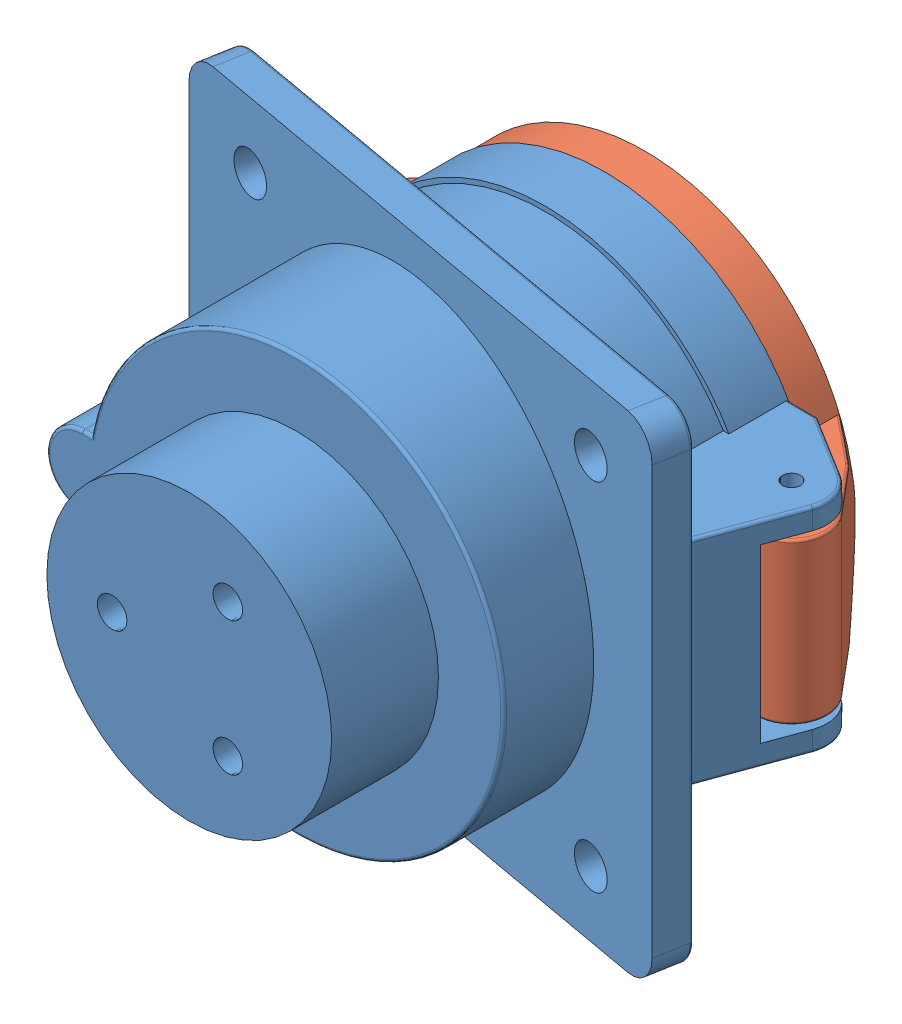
SolidWorks assembly Сборка 423-32.SLDASM, configuration По умолчанию (file format 10000). Lengths in mm.
Overall size (97.05 82 78.08).
2 component instances, 2 part files, 3 mates.
Components (placement in the parent):
- Корпус 423-1: Корпус 423.SLDPRT [По умолчанию] at (55.7199 50.6661 78.2341) size (97.05 82 70)
- Крышка 423-1: Крышка 423.SLDPRT [По умолчанию] at (55.7199 50.6661 28.2341) x (1 0 0) z (0 0 -1) size (91 71 25.59)
Mates (geometry in assembly coordinates):
- Концентричный1: concentric anti-aligned: cylinder of Корпус 423-1 through (55.7199 50.6661 26.2341) axis (0 0 1) radius 35; cylinder of Крышка 423-1 through (55.7199 50.6661 50.2341) axis (0 0 -1) radius 35.5
- Совпадение1: coincident anti-aligned: plane of Корпус 423-1 through (55.7199 50.6661 26.2341) normal (0 0 -1); plane of Крышка 423-1 through (55.7199 50.6661 26.2341) normal (0 0 1)
- Параллельность1: parallel anti-aligned: plane of Корпус 423-1 through (88.452 36.1661 46.2341) normal (0 1 0); plane of Крышка 423-1 through (98.7199 37.1661 37.7477) normal (0 -1 0)
